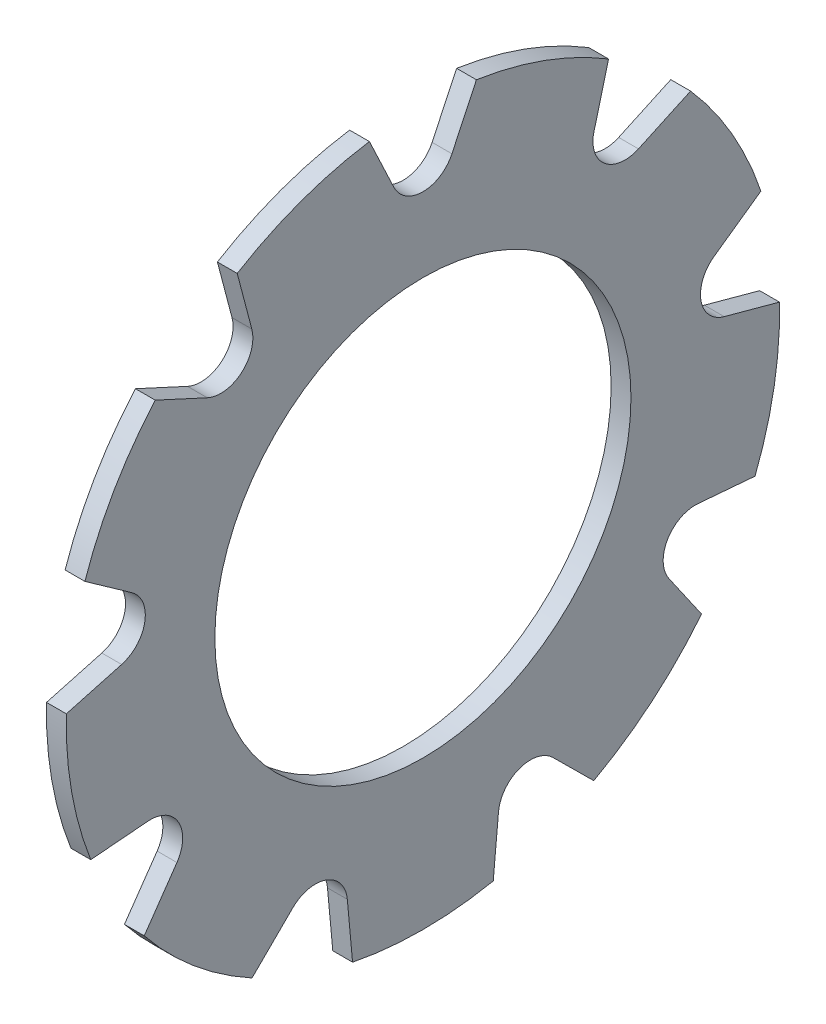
ISO-10303-21;
HEADER;
FILE_DESCRIPTION(('STEP AP214'),'2;1');
FILE_NAME('part.step','',(''),(''),'','','');
FILE_SCHEMA(('AUTOMOTIVE_DESIGN { 1 0 10303 214 1 1 1 1 }'));
ENDSEC;
DATA;
#1=APPLICATION_CONTEXT('core data for automotive mechanical design processes');
#2=APPLICATION_PROTOCOL_DEFINITION('international standard','automotive_design',2000,#1);
#3=PRODUCT_CONTEXT('',#1,'mechanical');
#4=PRODUCT('Part','Part','',(#3));
#5=PRODUCT_RELATED_PRODUCT_CATEGORY('part','',(#4));
#6=PRODUCT_DEFINITION_FORMATION('','',#4);
#7=PRODUCT_DEFINITION_CONTEXT('part definition',#1,'design');
#8=PRODUCT_DEFINITION('design','',#6,#7);
#9=PRODUCT_DEFINITION_SHAPE('','',#8);
#10=(LENGTH_UNIT() NAMED_UNIT(*) SI_UNIT(.MILLI.,.METRE.));
#11=(NAMED_UNIT(*) PLANE_ANGLE_UNIT() SI_UNIT($,.RADIAN.));
#12=(NAMED_UNIT(*) SI_UNIT($,.STERADIAN.) SOLID_ANGLE_UNIT());
#13=UNCERTAINTY_MEASURE_WITH_UNIT(LENGTH_MEASURE(1.E-05),#10,'distance_accuracy_value','');
#14=(GEOMETRIC_REPRESENTATION_CONTEXT(3) GLOBAL_UNCERTAINTY_ASSIGNED_CONTEXT((#13)) GLOBAL_UNIT_ASSIGNED_CONTEXT((#10,
#11,#12)) REPRESENTATION_CONTEXT('',''));
#15=CARTESIAN_POINT('',(0.,0.,0.));
#16=DIRECTION('',(0.,0.,1.));
#17=DIRECTION('',(1.,0.,0.));
#18=AXIS2_PLACEMENT_3D('',#15,#16,#17);
#19=CARTESIAN_POINT('',(-0.5,0.,0.));
#20=DIRECTION('',(1.,0.,0.));
#21=DIRECTION('',(0.,0.,-1.));
#22=AXIS2_PLACEMENT_3D('',#19,#20,#21);
#23=CYLINDRICAL_SURFACE('',#22,9.);
#24=DIRECTION('',(1.,0.,0.));
#25=VECTOR('',#24,1.);
#26=CARTESIAN_POINT('',(-0.5,5.94863345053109,-6.75379597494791));
#27=LINE('',#26,#25);
#28=CARTESIAN_POINT('',(-0.5,5.94863345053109,-6.75379597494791));
#29=VERTEX_POINT('',#28);
#30=CARTESIAN_POINT('',(0.,5.94863345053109,-6.75379597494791));
#31=VERTEX_POINT('',#30);
#32=EDGE_CURVE('E299',#29,#31,#27,.T.);
#33=ORIENTED_EDGE('',*,*,#32,.T.);
#34=CARTESIAN_POINT('',(0.,0.,0.));
#35=DIRECTION('',(1.,0.,0.));
#36=DIRECTION('',(0.,0.,-1.));
#37=AXIS2_PLACEMENT_3D('',#34,#35,#36);
#38=CIRCLE('',#37,9.);
#39=CARTESIAN_POINT('',(0.,2.87464216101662,-8.5285656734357));
#40=VERTEX_POINT('',#39);
#41=EDGE_CURVE('E526',#40,#31,#38,.T.);
#42=ORIENTED_EDGE('',*,*,#41,.F.);
#43=DIRECTION('',(1.,0.,0.));
#44=VECTOR('',#43,1.);
#45=CARTESIAN_POINT('',(-0.5,2.87464216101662,-8.5285656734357));
#46=LINE('',#45,#44);
#47=CARTESIAN_POINT('',(-0.5,2.87464216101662,-8.5285656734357));
#48=VERTEX_POINT('',#47);
#49=EDGE_CURVE('E59',#48,#40,#46,.T.);
#50=ORIENTED_EDGE('',*,*,#49,.F.);
#51=CARTESIAN_POINT('',(-0.5,0.,0.));
#52=DIRECTION('',(1.,0.,0.));
#53=DIRECTION('',(0.,0.,-1.));
#54=AXIS2_PLACEMENT_3D('',#51,#52,#53);
#55=CIRCLE('',#54,9.);
#56=EDGE_CURVE('E523',#48,#29,#55,.T.);
#57=ORIENTED_EDGE('',*,*,#56,.T.);
#58=EDGE_LOOP('',(#33,#42,#50,#57));
#59=FACE_BOUND('',#58,.T.);
#60=ADVANCED_FACE('F35',(#59),#23,.T.);
#61=DIRECTION('',(1.,0.,0.));
#62=VECTOR('',#61,1.);
#63=CARTESIAN_POINT('',(-0.5,0.215661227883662,-8.99741575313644));
#64=LINE('',#63,#62);
#65=CARTESIAN_POINT('',(-0.5,0.215661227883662,-8.99741575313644));
#66=VERTEX_POINT('',#65);
#67=CARTESIAN_POINT('',(0.,0.215661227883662,-8.99741575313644));
#68=VERTEX_POINT('',#67);
#69=EDGE_CURVE('E320',#66,#68,#64,.T.);
#70=ORIENTED_EDGE('',*,*,#69,.T.);
#71=CARTESIAN_POINT('',(0.,-3.2799526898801,-8.3810447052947));
#72=VERTEX_POINT('',#71);
#73=EDGE_CURVE('E528',#72,#68,#38,.T.);
#74=ORIENTED_EDGE('',*,*,#73,.F.);
#75=DIRECTION('',(1.,0.,0.));
#76=VECTOR('',#75,1.);
#77=CARTESIAN_POINT('',(-0.5,-3.2799526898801,-8.3810447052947));
#78=LINE('',#77,#76);
#79=CARTESIAN_POINT('',(-0.5,-3.2799526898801,-8.3810447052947));
#80=VERTEX_POINT('',#79);
#81=EDGE_CURVE('E345',#80,#72,#78,.T.);
#82=ORIENTED_EDGE('',*,*,#81,.F.);
#83=EDGE_CURVE('E621',#80,#66,#55,.T.);
#84=ORIENTED_EDGE('',*,*,#83,.T.);
#85=EDGE_LOOP('',(#70,#74,#82,#84));
#86=FACE_BOUND('',#85,.T.);
#87=ADVANCED_FACE('F619',(#86),#23,.T.);
#88=DIRECTION('',(1.,0.,0.));
#89=VECTOR('',#88,1.);
#90=CARTESIAN_POINT('',(-0.5,-5.6182212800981,-7.03104470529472));
#91=LINE('',#90,#89);
#92=CARTESIAN_POINT('',(-0.5,-5.6182212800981,-7.03104470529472));
#93=VERTEX_POINT('',#92);
#94=CARTESIAN_POINT('',(0.,-5.6182212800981,-7.03104470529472));
#95=VERTEX_POINT('',#94);
#96=EDGE_CURVE('E346',#93,#95,#91,.T.);
#97=ORIENTED_EDGE('',*,*,#96,.T.);
#98=CARTESIAN_POINT('',(0.,-7.89982122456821,-4.31193977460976));
#99=VERTEX_POINT('',#98);
#100=EDGE_CURVE('E531',#99,#95,#38,.T.);
#101=ORIENTED_EDGE('',*,*,#100,.F.);
#102=DIRECTION('',(1.,0.,0.));
#103=VECTOR('',#102,1.);
#104=CARTESIAN_POINT('',(-0.5,-7.89982122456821,-4.31193977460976));
#105=LINE('',#104,#103);
#106=CARTESIAN_POINT('',(-0.5,-7.89982122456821,-4.31193977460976));
#107=VERTEX_POINT('',#106);
#108=EDGE_CURVE('E371',#107,#99,#105,.T.);
#109=ORIENTED_EDGE('',*,*,#108,.F.);
#110=EDGE_CURVE('E607',#107,#93,#55,.T.);
#111=ORIENTED_EDGE('',*,*,#110,.T.);
#112=EDGE_LOOP('',(#97,#101,#109,#111));
#113=FACE_BOUND('',#112,.T.);
#114=ADVANCED_FACE('F605',(#113),#23,.T.);
#115=DIRECTION('',(1.,0.,0.));
#116=VECTOR('',#115,1.);
#117=CARTESIAN_POINT('',(-0.5,-8.82327561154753,-1.77476969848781));
#118=LINE('',#117,#116);
#119=CARTESIAN_POINT('',(-0.5,-8.82327561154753,-1.77476969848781));
#120=VERTEX_POINT('',#119);
#121=CARTESIAN_POINT('',(0.,-8.82327561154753,-1.77476969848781));
#122=VERTEX_POINT('',#121);
#123=EDGE_CURVE('E372',#120,#122,#118,.T.);
#124=ORIENTED_EDGE('',*,*,#123,.T.);
#125=CARTESIAN_POINT('',(0.,-8.82327561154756,1.77476969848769));
#126=VERTEX_POINT('',#125);
#127=EDGE_CURVE('E536',#126,#122,#38,.T.);
#128=ORIENTED_EDGE('',*,*,#127,.F.);
#129=DIRECTION('',(1.,0.,0.));
#130=VECTOR('',#129,1.);
#131=CARTESIAN_POINT('',(-0.5,-8.82327561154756,1.7747696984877));
#132=LINE('',#131,#130);
#133=CARTESIAN_POINT('',(-0.5,-8.82327561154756,1.7747696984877));
#134=VERTEX_POINT('',#133);
#135=EDGE_CURVE('E397',#134,#126,#132,.T.);
#136=ORIENTED_EDGE('',*,*,#135,.F.);
#137=EDGE_CURVE('E593',#134,#120,#55,.T.);
#138=ORIENTED_EDGE('',*,*,#137,.T.);
#139=EDGE_LOOP('',(#124,#128,#136,#138));
#140=FACE_BOUND('',#139,.T.);
#141=ADVANCED_FACE('F591',(#140),#23,.T.);
#142=DIRECTION('',(1.,0.,0.));
#143=VECTOR('',#142,1.);
#144=CARTESIAN_POINT('',(-0.5,-7.89982122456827,4.31193977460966));
#145=LINE('',#144,#143);
#146=CARTESIAN_POINT('',(-0.5,-7.89982122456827,4.31193977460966));
#147=VERTEX_POINT('',#146);
#148=CARTESIAN_POINT('',(0.,-7.89982122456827,4.31193977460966));
#149=VERTEX_POINT('',#148);
#150=EDGE_CURVE('E398',#147,#149,#145,.T.);
#151=ORIENTED_EDGE('',*,*,#150,.T.);
#152=CARTESIAN_POINT('',(0.,-5.61822128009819,7.03104470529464));
#153=VERTEX_POINT('',#152);
#154=EDGE_CURVE('E541',#153,#149,#38,.T.);
#155=ORIENTED_EDGE('',*,*,#154,.F.);
#156=DIRECTION('',(1.,0.,0.));
#157=VECTOR('',#156,1.);
#158=CARTESIAN_POINT('',(-0.5,-5.61822128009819,7.03104470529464));
#159=LINE('',#158,#157);
#160=CARTESIAN_POINT('',(-0.5,-5.61822128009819,7.03104470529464));
#161=VERTEX_POINT('',#160);
#162=EDGE_CURVE('E423',#161,#153,#159,.T.);
#163=ORIENTED_EDGE('',*,*,#162,.F.);
#164=EDGE_CURVE('E579',#161,#147,#55,.T.);
#165=ORIENTED_EDGE('',*,*,#164,.T.);
#166=EDGE_LOOP('',(#151,#155,#163,#165));
#167=FACE_BOUND('',#166,.T.);
#168=ADVANCED_FACE('F577',(#167),#23,.T.);
#169=DIRECTION('',(1.,0.,0.));
#170=VECTOR('',#169,1.);
#171=CARTESIAN_POINT('',(-0.5,-3.27995268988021,8.38104470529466));
#172=LINE('',#171,#170);
#173=CARTESIAN_POINT('',(-0.5,-3.27995268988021,8.38104470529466));
#174=VERTEX_POINT('',#173);
#175=CARTESIAN_POINT('',(0.,-3.27995268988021,8.38104470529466));
#176=VERTEX_POINT('',#175);
#177=EDGE_CURVE('E424',#174,#176,#172,.T.);
#178=ORIENTED_EDGE('',*,*,#177,.T.);
#179=CARTESIAN_POINT('',(0.,0.215661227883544,8.99741575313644));
#180=VERTEX_POINT('',#179);
#181=EDGE_CURVE('E525',#180,#176,#38,.T.);
#182=ORIENTED_EDGE('',*,*,#181,.F.);
#183=DIRECTION('',(1.,0.,0.));
#184=VECTOR('',#183,1.);
#185=CARTESIAN_POINT('',(-0.5,0.215661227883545,8.99741575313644));
#186=LINE('',#185,#184);
#187=CARTESIAN_POINT('',(-0.5,0.215661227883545,8.99741575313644));
#188=VERTEX_POINT('',#187);
#189=EDGE_CURVE('E449',#188,#180,#186,.T.);
#190=ORIENTED_EDGE('',*,*,#189,.F.);
#191=EDGE_CURVE('E564',#188,#174,#55,.T.);
#192=ORIENTED_EDGE('',*,*,#191,.T.);
#193=EDGE_LOOP('',(#178,#182,#190,#192));
#194=FACE_BOUND('',#193,.T.);
#195=ADVANCED_FACE('F561',(#194),#23,.T.);
#196=DIRECTION('',(1.,0.,0.));
#197=VECTOR('',#196,1.);
#198=CARTESIAN_POINT('',(-0.5,2.87464216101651,8.52856567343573));
#199=LINE('',#198,#197);
#200=CARTESIAN_POINT('',(-0.5,2.87464216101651,8.52856567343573));
#201=VERTEX_POINT('',#200);
#202=CARTESIAN_POINT('',(0.,2.87464216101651,8.52856567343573));
#203=VERTEX_POINT('',#202);
#204=EDGE_CURVE('E450',#201,#203,#199,.T.);
#205=ORIENTED_EDGE('',*,*,#204,.T.);
#206=CARTESIAN_POINT('',(0.,5.948633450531,6.75379597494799));
#207=VERTEX_POINT('',#206);
#208=EDGE_CURVE('E519',#207,#203,#38,.T.);
#209=ORIENTED_EDGE('',*,*,#208,.F.);
#210=DIRECTION('',(1.,0.,0.));
#211=VECTOR('',#210,1.);
#212=CARTESIAN_POINT('',(-0.5,5.948633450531,6.75379597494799));
#213=LINE('',#212,#211);
#214=CARTESIAN_POINT('',(-0.5,5.948633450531,6.75379597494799));
#215=VERTEX_POINT('',#214);
#216=EDGE_CURVE('E475',#215,#207,#213,.T.);
#217=ORIENTED_EDGE('',*,*,#216,.F.);
#218=EDGE_CURVE('E43',#215,#201,#55,.T.);
#219=ORIENTED_EDGE('',*,*,#218,.T.);
#220=EDGE_LOOP('',(#205,#209,#217,#219));
#221=FACE_BOUND('',#220,.T.);
#222=ADVANCED_FACE('F664',(#221),#23,.T.);
#223=DIRECTION('',(1.,0.,0.));
#224=VECTOR('',#223,1.);
#225=CARTESIAN_POINT('',(-0.5,7.68415999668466,4.68547597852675));
#226=LINE('',#225,#224);
#227=CARTESIAN_POINT('',(-0.5,7.68415999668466,4.68547597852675));
#228=VERTEX_POINT('',#227);
#229=CARTESIAN_POINT('',(0.,7.68415999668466,4.68547597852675));
#230=VERTEX_POINT('',#229);
#231=EDGE_CURVE('E476',#228,#230,#226,.T.);
#232=ORIENTED_EDGE('',*,*,#231,.T.);
#233=CARTESIAN_POINT('',(0.,8.89817396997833,1.35));
#234=VERTEX_POINT('',#233);
#235=EDGE_CURVE('E517',#234,#230,#38,.T.);
#236=ORIENTED_EDGE('',*,*,#235,.F.);
#237=DIRECTION('',(1.,0.,0.));
#238=VECTOR('',#237,1.);
#239=CARTESIAN_POINT('',(-0.5,8.89817396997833,1.35));
#240=LINE('',#239,#238);
#241=CARTESIAN_POINT('',(-0.5,8.89817396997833,1.35));
#242=VERTEX_POINT('',#241);
#243=EDGE_CURVE('E502',#242,#234,#240,.T.);
#244=ORIENTED_EDGE('',*,*,#243,.F.);
#245=EDGE_CURVE('E11',#242,#228,#55,.T.);
#246=ORIENTED_EDGE('',*,*,#245,.T.);
#247=EDGE_LOOP('',(#232,#236,#244,#246));
#248=FACE_BOUND('',#247,.T.);
#249=ADVANCED_FACE('F649',(#248),#23,.T.);
#250=DIRECTION('',(1.,0.,0.));
#251=VECTOR('',#250,1.);
#252=CARTESIAN_POINT('',(-0.5,7.68415999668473,-4.68547597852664));
#253=LINE('',#252,#251);
#254=CARTESIAN_POINT('',(-0.5,7.68415999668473,-4.68547597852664));
#255=VERTEX_POINT('',#254);
#256=CARTESIAN_POINT('',(0.,7.68415999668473,-4.68547597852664));
#257=VERTEX_POINT('',#256);
#258=EDGE_CURVE('E51',#255,#257,#253,.T.);
#259=ORIENTED_EDGE('',*,*,#258,.F.);
#260=CARTESIAN_POINT('',(-0.5,8.89817396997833,-1.35));
#261=VERTEX_POINT('',#260);
#262=EDGE_CURVE('E44',#255,#261,#55,.T.);
#263=ORIENTED_EDGE('',*,*,#262,.T.);
#264=DIRECTION('',(1.,0.,0.));
#265=VECTOR('',#264,1.);
#266=CARTESIAN_POINT('',(-0.5,8.89817396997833,-1.35));
#267=LINE('',#266,#265);
#268=CARTESIAN_POINT('',(0.,8.89817396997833,-1.35));
#269=VERTEX_POINT('',#268);
#270=EDGE_CURVE('E503',#261,#269,#267,.T.);
#271=ORIENTED_EDGE('',*,*,#270,.T.);
#272=EDGE_CURVE('E516',#257,#269,#38,.T.);
#273=ORIENTED_EDGE('',*,*,#272,.F.);
#274=EDGE_LOOP('',(#259,#263,#271,#273));
#275=FACE_BOUND('',#274,.T.);
#276=ADVANCED_FACE('F37',(#275),#23,.T.);
#277=CARTESIAN_POINT('',(-0.5,0.,0.));
#278=DIRECTION('',(1.,0.,0.));
#279=DIRECTION('',(0.,0.,-1.));
#280=AXIS2_PLACEMENT_3D('',#277,#278,#279);
#281=PLANE('',#280);
#282=CARTESIAN_POINT('',(-0.5,0.,0.));
#283=DIRECTION('',(1.,0.,0.));
#284=DIRECTION('',(0.,0.,-1.));
#285=AXIS2_PLACEMENT_3D('',#282,#283,#284);
#286=CIRCLE('',#285,5.25);
#287=CARTESIAN_POINT('',(-0.5,0.,-5.25));
#288=VERTEX_POINT('',#287);
#289=EDGE_CURVE('E514',#288,#288,#286,.T.);
#290=ORIENTED_EDGE('',*,*,#289,.T.);
#291=EDGE_LOOP('',(#290));
#292=FACE_BOUND('',#291,.T.);
#293=CARTESIAN_POINT('',(-0.5,6.07856265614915,-5.10051968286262));
#294=DIRECTION('',(1.,0.,0.));
#295=DIRECTION('',(0.,-0.64278760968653,-0.766044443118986));
#296=AXIS2_PLACEMENT_3D('',#293,#294,#295);
#297=CIRCLE('',#296,0.809999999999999);
#298=CARTESIAN_POINT('',(-0.5,6.28470657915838,-4.31719045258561));
#299=VERTEX_POINT('',#298);
#300=CARTESIAN_POINT('',(-0.5,5.34293047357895,-5.43955550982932));
#301=VERTEX_POINT('',#300);
#302=EDGE_CURVE('E277',#299,#301,#297,.T.);
#303=ORIENTED_EDGE('',*,*,#302,.T.);
#304=DIRECTION('',(0.,0.418562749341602,-0.908187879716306));
#305=VECTOR('',#304,1.);
#306=CARTESIAN_POINT('',(-0.5,5.34293047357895,-5.43955550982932));
#307=LINE('',#306,#305);
#308=EDGE_CURVE('E296',#301,#29,#307,.T.);
#309=ORIENTED_EDGE('',*,*,#308,.T.);
#310=ORIENTED_EDGE('',*,*,#56,.F.);
#311=DIRECTION('',(0.,-0.577232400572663,0.816579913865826));
#312=VECTOR('',#311,1.);
#313=CARTESIAN_POINT('',(-0.5,2.03932802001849,-7.346891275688));
#314=LINE('',#313,#312);
#315=CARTESIAN_POINT('',(-0.5,2.03932802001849,-7.346891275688));
#316=VERTEX_POINT('',#315);
#317=EDGE_CURVE('E311',#48,#316,#314,.T.);
#318=ORIENTED_EDGE('',*,*,#317,.T.);
#319=CARTESIAN_POINT('',(-0.5,1.37789828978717,-7.81444952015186));
#320=DIRECTION('',(1.,0.,0.));
#321=DIRECTION('',(0.,-0.984807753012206,-0.17364817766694));
#322=AXIS2_PLACEMENT_3D('',#319,#320,#321);
#323=CIRCLE('',#322,0.809999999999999);
#324=CARTESIAN_POINT('',(-0.5,0.596443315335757,-7.60131077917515));
#325=VERTEX_POINT('',#324);
#326=EDGE_CURVE('E314',#316,#325,#323,.T.);
#327=ORIENTED_EDGE('',*,*,#326,.T.);
#328=DIRECTION('',(0.,-0.263134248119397,-0.964759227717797));
#329=VECTOR('',#328,1.);
#330=CARTESIAN_POINT('',(-0.5,0.596443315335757,-7.60131077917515));
#331=LINE('',#330,#329);
#332=EDGE_CURVE('E317',#325,#66,#331,.T.);
#333=ORIENTED_EDGE('',*,*,#332,.T.);
#334=ORIENTED_EDGE('',*,*,#83,.F.);
#335=DIRECTION('',(0.,0.0827017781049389,0.996574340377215));
#336=VECTOR('',#335,1.);
#337=CARTESIAN_POINT('',(-0.5,-3.16027478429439,-6.93890001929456));
#338=LINE('',#337,#336);
#339=CARTESIAN_POINT('',(-0.5,-3.16027478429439,-6.93890001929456));
#340=VERTEX_POINT('',#339);
#341=EDGE_CURVE('E336',#80,#340,#338,.T.);
#342=ORIENTED_EDGE('',*,*,#341,.T.);
#343=CARTESIAN_POINT('',(-0.5,-3.96749999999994,-6.87191157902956));
#344=DIRECTION('',(1.,0.,0.));
#345=DIRECTION('',(0.,-0.866025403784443,0.499999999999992));
#346=AXIS2_PLACEMENT_3D('',#343,#344,#345);
#347=CIRCLE('',#346,0.809999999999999);
#348=CARTESIAN_POINT('',(-0.5,-4.42912629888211,-6.20632825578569));
#349=VERTEX_POINT('',#348);
#350=EDGE_CURVE('E339',#340,#349,#347,.T.);
#351=ORIENTED_EDGE('',*,*,#350,.T.);
#352=DIRECTION('',(0.,-0.821707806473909,-0.569909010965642));
#353=VECTOR('',#352,1.);
#354=CARTESIAN_POINT('',(-0.5,-4.42912629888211,-6.20632825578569));
#355=LINE('',#354,#353);
#356=EDGE_CURVE('E342',#349,#93,#355,.T.);
#357=ORIENTED_EDGE('',*,*,#356,.T.);
#358=ORIENTED_EDGE('',*,*,#110,.F.);
#359=DIRECTION('',(0.,0.703938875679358,0.710260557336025));
#360=VECTOR('',#359,1.);
#361=CARTESIAN_POINT('',(-0.5,-6.88114989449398,-3.28412032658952));
#362=LINE('',#361,#360);
#363=CARTESIAN_POINT('',(-0.5,-6.88114989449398,-3.28412032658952));
#364=VERTEX_POINT('',#363);
#365=EDGE_CURVE('E362',#107,#364,#362,.T.);
#366=ORIENTED_EDGE('',*,*,#365,.T.);
#367=CARTESIAN_POINT('',(-0.5,-7.45646094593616,-2.71392983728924));
#368=DIRECTION('',(1.,0.,0.));
#369=DIRECTION('',(0.,-0.342020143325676,0.939692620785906));
#370=AXIS2_PLACEMENT_3D('',#367,#368,#369);
#371=CIRCLE('',#370,0.809999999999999);
#372=CARTESIAN_POINT('',(-0.5,-7.38225849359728,-1.9073357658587));
#373=VERTEX_POINT('',#372);
#374=EDGE_CURVE('E365',#364,#373,#371,.T.);
#375=ORIENTED_EDGE('',*,*,#374,.T.);
#376=DIRECTION('',(0.,-0.995795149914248,0.0916079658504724));
#377=VECTOR('',#376,1.);
#378=CARTESIAN_POINT('',(-0.5,-7.38225849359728,-1.9073357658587));
#379=LINE('',#378,#377);
#380=EDGE_CURVE('E368',#373,#120,#379,.T.);
#381=ORIENTED_EDGE('',*,*,#380,.T.);
#382=ORIENTED_EDGE('',*,*,#137,.F.);
#383=DIRECTION('',(0.,0.995795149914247,0.0916079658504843));
#384=VECTOR('',#383,1.);
#385=CARTESIAN_POINT('',(-0.5,-7.38225849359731,1.9073357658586));
#386=LINE('',#385,#384);
#387=CARTESIAN_POINT('',(-0.5,-7.38225849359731,1.9073357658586));
#388=VERTEX_POINT('',#387);
#389=EDGE_CURVE('E388',#134,#388,#386,.T.);
#390=ORIENTED_EDGE('',*,*,#389,.T.);
#391=CARTESIAN_POINT('',(-0.5,-7.4564609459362,2.71392983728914));
#392=DIRECTION('',(1.,0.,0.));
#393=DIRECTION('',(0.,0.342020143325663,0.939692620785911));
#394=AXIS2_PLACEMENT_3D('',#391,#392,#393);
#395=CIRCLE('',#394,0.809999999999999);
#396=CARTESIAN_POINT('',(-0.5,-6.88114989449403,3.28412032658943));
#397=VERTEX_POINT('',#396);
#398=EDGE_CURVE('E391',#388,#397,#395,.T.);
#399=ORIENTED_EDGE('',*,*,#398,.T.);
#400=DIRECTION('',(0.,-0.703938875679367,0.710260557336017));
#401=VECTOR('',#400,1.);
#402=CARTESIAN_POINT('',(-0.5,-6.88114989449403,3.28412032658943));
#403=LINE('',#402,#401);
#404=EDGE_CURVE('E394',#397,#147,#403,.T.);
#405=ORIENTED_EDGE('',*,*,#404,.T.);
#406=ORIENTED_EDGE('',*,*,#164,.F.);
#407=DIRECTION('',(0.,0.821707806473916,-0.569909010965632));
#408=VECTOR('',#407,1.);
#409=CARTESIAN_POINT('',(-0.5,-4.42912629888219,6.20632825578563));
#410=LINE('',#409,#408);
#411=CARTESIAN_POINT('',(-0.5,-4.42912629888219,6.20632825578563));
#412=VERTEX_POINT('',#411);
#413=EDGE_CURVE('E414',#161,#412,#410,.T.);
#414=ORIENTED_EDGE('',*,*,#413,.T.);
#415=CARTESIAN_POINT('',(-0.5,-3.96750000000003,6.8719115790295));
#416=DIRECTION('',(1.,0.,0.));
#417=DIRECTION('',(0.,0.866025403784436,0.500000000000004));
#418=AXIS2_PLACEMENT_3D('',#415,#416,#417);
#419=CIRCLE('',#418,0.809999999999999);
#420=CARTESIAN_POINT('',(-0.5,-3.16027478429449,6.93890001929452));
#421=VERTEX_POINT('',#420);
#422=EDGE_CURVE('E417',#412,#421,#419,.T.);
#423=ORIENTED_EDGE('',*,*,#422,.T.);
#424=DIRECTION('',(0.,-0.0827017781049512,0.996574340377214));
#425=VECTOR('',#424,1.);
#426=CARTESIAN_POINT('',(-0.5,-3.16027478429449,6.93890001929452));
#427=LINE('',#426,#425);
#428=EDGE_CURVE('E420',#421,#174,#427,.T.);
#429=ORIENTED_EDGE('',*,*,#428,.T.);
#430=ORIENTED_EDGE('',*,*,#191,.F.);
#431=DIRECTION('',(0.,0.263134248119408,-0.964759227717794));
#432=VECTOR('',#431,1.);
#433=CARTESIAN_POINT('',(-0.5,0.596443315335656,7.60131077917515));
#434=LINE('',#433,#432);
#435=CARTESIAN_POINT('',(-0.5,0.596443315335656,7.60131077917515));
#436=VERTEX_POINT('',#435);
#437=EDGE_CURVE('E440',#188,#436,#434,.T.);
#438=ORIENTED_EDGE('',*,*,#437,.T.);
#439=CARTESIAN_POINT('',(-0.5,1.37789828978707,7.81444952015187));
#440=DIRECTION('',(1.,0.,0.));
#441=DIRECTION('',(0.,0.984807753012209,-0.173648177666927));
#442=AXIS2_PLACEMENT_3D('',#439,#440,#441);
#443=CIRCLE('',#442,0.809999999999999);
#444=CARTESIAN_POINT('',(-0.5,2.03932802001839,7.34689127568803));
#445=VERTEX_POINT('',#444);
#446=EDGE_CURVE('E443',#436,#445,#443,.T.);
#447=ORIENTED_EDGE('',*,*,#446,.T.);
#448=DIRECTION('',(0.,0.577232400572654,0.816579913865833));
#449=VECTOR('',#448,1.);
#450=CARTESIAN_POINT('',(-0.5,2.03932802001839,7.34689127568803));
#451=LINE('',#450,#449);
#452=EDGE_CURVE('E446',#445,#201,#451,.T.);
#453=ORIENTED_EDGE('',*,*,#452,.T.);
#454=ORIENTED_EDGE('',*,*,#218,.F.);
#455=DIRECTION('',(0.,-0.418562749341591,-0.908187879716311));
#456=VECTOR('',#455,1.);
#457=CARTESIAN_POINT('',(-0.5,5.34293047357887,5.43955550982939));
#458=LINE('',#457,#456);
#459=CARTESIAN_POINT('',(-0.5,5.34293047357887,5.43955550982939));
#460=VERTEX_POINT('',#459);
#461=EDGE_CURVE('E466',#215,#460,#458,.T.);
#462=ORIENTED_EDGE('',*,*,#461,.T.);
#463=CARTESIAN_POINT('',(-0.5,6.07856265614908,5.1005196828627));
#464=DIRECTION('',(1.,0.,0.));
#465=DIRECTION('',(0.,0.642787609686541,-0.766044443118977));
#466=AXIS2_PLACEMENT_3D('',#463,#464,#465);
#467=CIRCLE('',#466,0.809999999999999);
#468=CARTESIAN_POINT('',(-0.5,6.28470657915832,4.3171904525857));
#469=VERTEX_POINT('',#468);
#470=EDGE_CURVE('E469',#460,#469,#467,.T.);
#471=ORIENTED_EDGE('',*,*,#470,.T.);
#472=DIRECTION('',(0.,0.967073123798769,0.254498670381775));
#473=VECTOR('',#472,1.);
#474=CARTESIAN_POINT('',(-0.5,6.28470657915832,4.3171904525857));
#475=LINE('',#474,#473);
#476=EDGE_CURVE('E472',#469,#228,#475,.T.);
#477=ORIENTED_EDGE('',*,*,#476,.T.);
#478=ORIENTED_EDGE('',*,*,#245,.F.);
#479=DIRECTION('',(0.,-0.904409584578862,-0.426665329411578));
#480=VECTOR('',#479,1.);
#481=CARTESIAN_POINT('',(-0.5,7.58940108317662,0.732571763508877));
#482=LINE('',#481,#480);
#483=CARTESIAN_POINT('',(-0.5,7.58940108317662,0.732571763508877));
#484=VERTEX_POINT('',#483);
#485=EDGE_CURVE('E493',#242,#484,#482,.T.);
#486=ORIENTED_EDGE('',*,*,#485,.T.);
#487=CARTESIAN_POINT('',(-0.5,7.935,0.));
#488=DIRECTION('',(1.,0.,0.));
#489=DIRECTION('',(0.,0.,-1.));
#490=AXIS2_PLACEMENT_3D('',#487,#488,#489);
#491=CIRCLE('',#490,0.809999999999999);
#492=CARTESIAN_POINT('',(-0.5,7.58940108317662,-0.732571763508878));
#493=VERTEX_POINT('',#492);
#494=EDGE_CURVE('E496',#484,#493,#491,.T.);
#495=ORIENTED_EDGE('',*,*,#494,.T.);
#496=DIRECTION('',(0.,0.904409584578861,-0.42666532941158));
#497=VECTOR('',#496,1.);
#498=CARTESIAN_POINT('',(-0.5,7.58940108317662,-0.732571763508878));
#499=LINE('',#498,#497);
#500=EDGE_CURVE('E499',#493,#261,#499,.T.);
#501=ORIENTED_EDGE('',*,*,#500,.T.);
#502=ORIENTED_EDGE('',*,*,#262,.F.);
#503=DIRECTION('',(0.,-0.967073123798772,0.254498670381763));
#504=VECTOR('',#503,1.);
#505=CARTESIAN_POINT('',(-0.5,6.28470657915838,-4.31719045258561));
#506=LINE('',#505,#504);
#507=EDGE_CURVE('E291',#255,#299,#506,.T.);
#508=ORIENTED_EDGE('',*,*,#507,.T.);
#509=EDGE_LOOP('',(#303,#309,#310,#318,#327,#333,#334,#342,#351,#357,#358,#366,#375,#381,#382,
#390,#399,#405,#406,#414,#423,#429,#430,#438,#447,#453,#454,#462,#471,#477,#478,#486,#495,#501,
#502,#508));
#510=FACE_BOUND('',#509,.T.);
#511=ADVANCED_FACE('F569',(#292,#510),#281,.F.);
#512=CARTESIAN_POINT('',(0.,0.,0.));
#513=DIRECTION('',(1.,0.,0.));
#514=DIRECTION('',(0.,0.,-1.));
#515=AXIS2_PLACEMENT_3D('',#512,#513,#514);
#516=PLANE('',#515);
#517=DIRECTION('',(0.,0.418562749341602,-0.908187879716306));
#518=VECTOR('',#517,1.);
#519=CARTESIAN_POINT('',(0.,5.34293047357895,-5.43955550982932));
#520=LINE('',#519,#518);
#521=CARTESIAN_POINT('',(0.,5.34293047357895,-5.43955550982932));
#522=VERTEX_POINT('',#521);
#523=EDGE_CURVE('E289',#522,#31,#520,.T.);
#524=ORIENTED_EDGE('',*,*,#523,.F.);
#525=CARTESIAN_POINT('',(0.,6.07856265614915,-5.10051968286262));
#526=DIRECTION('',(1.,0.,0.));
#527=DIRECTION('',(0.,-0.64278760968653,-0.766044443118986));
#528=AXIS2_PLACEMENT_3D('',#525,#526,#527);
#529=CIRCLE('',#528,0.809999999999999);
#530=CARTESIAN_POINT('',(0.,6.28470657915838,-4.31719045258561));
#531=VERTEX_POINT('',#530);
#532=EDGE_CURVE('E274',#531,#522,#529,.T.);
#533=ORIENTED_EDGE('',*,*,#532,.F.);
#534=DIRECTION('',(0.,-0.967073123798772,0.254498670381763));
#535=VECTOR('',#534,1.);
#536=CARTESIAN_POINT('',(0.,6.28470657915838,-4.31719045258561));
#537=LINE('',#536,#535);
#538=EDGE_CURVE('E281',#257,#531,#537,.T.);
#539=ORIENTED_EDGE('',*,*,#538,.F.);
#540=ORIENTED_EDGE('',*,*,#272,.T.);
#541=DIRECTION('',(0.,0.904409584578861,-0.42666532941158));
#542=VECTOR('',#541,1.);
#543=CARTESIAN_POINT('',(0.,7.58940108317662,-0.732571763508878));
#544=LINE('',#543,#542);
#545=CARTESIAN_POINT('',(0.,7.58940108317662,-0.732571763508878));
#546=VERTEX_POINT('',#545);
#547=EDGE_CURVE('E490',#546,#269,#544,.T.);
#548=ORIENTED_EDGE('',*,*,#547,.F.);
#549=CARTESIAN_POINT('',(0.,7.935,0.));
#550=DIRECTION('',(1.,0.,0.));
#551=DIRECTION('',(0.,0.,-1.));
#552=AXIS2_PLACEMENT_3D('',#549,#550,#551);
#553=CIRCLE('',#552,0.809999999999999);
#554=CARTESIAN_POINT('',(0.,7.58940108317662,0.732571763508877));
#555=VERTEX_POINT('',#554);
#556=EDGE_CURVE('E487',#555,#546,#553,.T.);
#557=ORIENTED_EDGE('',*,*,#556,.F.);
#558=DIRECTION('',(0.,-0.904409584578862,-0.426665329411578));
#559=VECTOR('',#558,1.);
#560=CARTESIAN_POINT('',(0.,7.58940108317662,0.732571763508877));
#561=LINE('',#560,#559);
#562=EDGE_CURVE('E479',#234,#555,#561,.T.);
#563=ORIENTED_EDGE('',*,*,#562,.F.);
#564=ORIENTED_EDGE('',*,*,#235,.T.);
#565=DIRECTION('',(0.,0.967073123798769,0.254498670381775));
#566=VECTOR('',#565,1.);
#567=CARTESIAN_POINT('',(0.,6.28470657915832,4.3171904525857));
#568=LINE('',#567,#566);
#569=CARTESIAN_POINT('',(0.,6.28470657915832,4.3171904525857));
#570=VERTEX_POINT('',#569);
#571=EDGE_CURVE('E464',#570,#230,#568,.T.);
#572=ORIENTED_EDGE('',*,*,#571,.F.);
#573=CARTESIAN_POINT('',(0.,6.07856265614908,5.1005196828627));
#574=DIRECTION('',(1.,0.,0.));
#575=DIRECTION('',(0.,0.642787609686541,-0.766044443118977));
#576=AXIS2_PLACEMENT_3D('',#573,#574,#575);
#577=CIRCLE('',#576,0.809999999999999);
#578=CARTESIAN_POINT('',(0.,5.34293047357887,5.43955550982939));
#579=VERTEX_POINT('',#578);
#580=EDGE_CURVE('E461',#579,#570,#577,.T.);
#581=ORIENTED_EDGE('',*,*,#580,.F.);
#582=DIRECTION('',(0.,-0.418562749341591,-0.908187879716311));
#583=VECTOR('',#582,1.);
#584=CARTESIAN_POINT('',(0.,5.34293047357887,5.43955550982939));
#585=LINE('',#584,#583);
#586=EDGE_CURVE('E453',#207,#579,#585,.T.);
#587=ORIENTED_EDGE('',*,*,#586,.F.);
#588=ORIENTED_EDGE('',*,*,#208,.T.);
#589=DIRECTION('',(0.,0.577232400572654,0.816579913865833));
#590=VECTOR('',#589,1.);
#591=CARTESIAN_POINT('',(0.,2.03932802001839,7.34689127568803));
#592=LINE('',#591,#590);
#593=CARTESIAN_POINT('',(0.,2.03932802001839,7.34689127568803));
#594=VERTEX_POINT('',#593);
#595=EDGE_CURVE('E438',#594,#203,#592,.T.);
#596=ORIENTED_EDGE('',*,*,#595,.F.);
#597=CARTESIAN_POINT('',(0.,1.37789828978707,7.81444952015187));
#598=DIRECTION('',(1.,0.,0.));
#599=DIRECTION('',(0.,0.984807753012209,-0.173648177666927));
#600=AXIS2_PLACEMENT_3D('',#597,#598,#599);
#601=CIRCLE('',#600,0.809999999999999);
#602=CARTESIAN_POINT('',(0.,0.596443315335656,7.60131077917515));
#603=VERTEX_POINT('',#602);
#604=EDGE_CURVE('E435',#603,#594,#601,.T.);
#605=ORIENTED_EDGE('',*,*,#604,.F.);
#606=DIRECTION('',(0.,0.263134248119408,-0.964759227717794));
#607=VECTOR('',#606,1.);
#608=CARTESIAN_POINT('',(0.,0.596443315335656,7.60131077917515));
#609=LINE('',#608,#607);
#610=EDGE_CURVE('E427',#180,#603,#609,.T.);
#611=ORIENTED_EDGE('',*,*,#610,.F.);
#612=ORIENTED_EDGE('',*,*,#181,.T.);
#613=DIRECTION('',(0.,-0.0827017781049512,0.996574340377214));
#614=VECTOR('',#613,1.);
#615=CARTESIAN_POINT('',(0.,-3.16027478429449,6.93890001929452));
#616=LINE('',#615,#614);
#617=CARTESIAN_POINT('',(0.,-3.16027478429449,6.93890001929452));
#618=VERTEX_POINT('',#617);
#619=EDGE_CURVE('E412',#618,#176,#616,.T.);
#620=ORIENTED_EDGE('',*,*,#619,.F.);
#621=CARTESIAN_POINT('',(0.,-3.96750000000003,6.8719115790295));
#622=DIRECTION('',(1.,0.,0.));
#623=DIRECTION('',(0.,0.866025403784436,0.500000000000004));
#624=AXIS2_PLACEMENT_3D('',#621,#622,#623);
#625=CIRCLE('',#624,0.809999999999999);
#626=CARTESIAN_POINT('',(0.,-4.42912629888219,6.20632825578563));
#627=VERTEX_POINT('',#626);
#628=EDGE_CURVE('E409',#627,#618,#625,.T.);
#629=ORIENTED_EDGE('',*,*,#628,.F.);
#630=DIRECTION('',(0.,0.821707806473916,-0.569909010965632));
#631=VECTOR('',#630,1.);
#632=CARTESIAN_POINT('',(0.,-4.42912629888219,6.20632825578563));
#633=LINE('',#632,#631);
#634=EDGE_CURVE('E401',#153,#627,#633,.T.);
#635=ORIENTED_EDGE('',*,*,#634,.F.);
#636=ORIENTED_EDGE('',*,*,#154,.T.);
#637=DIRECTION('',(0.,-0.703938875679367,0.710260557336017));
#638=VECTOR('',#637,1.);
#639=CARTESIAN_POINT('',(0.,-6.88114989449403,3.28412032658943));
#640=LINE('',#639,#638);
#641=CARTESIAN_POINT('',(0.,-6.88114989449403,3.28412032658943));
#642=VERTEX_POINT('',#641);
#643=EDGE_CURVE('E386',#642,#149,#640,.T.);
#644=ORIENTED_EDGE('',*,*,#643,.F.);
#645=CARTESIAN_POINT('',(0.,-7.4564609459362,2.71392983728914));
#646=DIRECTION('',(1.,0.,0.));
#647=DIRECTION('',(0.,0.342020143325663,0.939692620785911));
#648=AXIS2_PLACEMENT_3D('',#645,#646,#647);
#649=CIRCLE('',#648,0.809999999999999);
#650=CARTESIAN_POINT('',(0.,-7.38225849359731,1.9073357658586));
#651=VERTEX_POINT('',#650);
#652=EDGE_CURVE('E383',#651,#642,#649,.T.);
#653=ORIENTED_EDGE('',*,*,#652,.F.);
#654=DIRECTION('',(0.,0.995795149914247,0.0916079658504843));
#655=VECTOR('',#654,1.);
#656=CARTESIAN_POINT('',(0.,-7.38225849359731,1.9073357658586));
#657=LINE('',#656,#655);
#658=EDGE_CURVE('E375',#126,#651,#657,.T.);
#659=ORIENTED_EDGE('',*,*,#658,.F.);
#660=ORIENTED_EDGE('',*,*,#127,.T.);
#661=DIRECTION('',(0.,-0.995795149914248,0.0916079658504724));
#662=VECTOR('',#661,1.);
#663=CARTESIAN_POINT('',(0.,-7.38225849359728,-1.9073357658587));
#664=LINE('',#663,#662);
#665=CARTESIAN_POINT('',(0.,-7.38225849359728,-1.9073357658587));
#666=VERTEX_POINT('',#665);
#667=EDGE_CURVE('E360',#666,#122,#664,.T.);
#668=ORIENTED_EDGE('',*,*,#667,.F.);
#669=CARTESIAN_POINT('',(0.,-7.45646094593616,-2.71392983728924));
#670=DIRECTION('',(1.,0.,0.));
#671=DIRECTION('',(0.,-0.342020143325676,0.939692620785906));
#672=AXIS2_PLACEMENT_3D('',#669,#670,#671);
#673=CIRCLE('',#672,0.809999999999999);
#674=CARTESIAN_POINT('',(0.,-6.88114989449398,-3.28412032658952));
#675=VERTEX_POINT('',#674);
#676=EDGE_CURVE('E357',#675,#666,#673,.T.);
#677=ORIENTED_EDGE('',*,*,#676,.F.);
#678=DIRECTION('',(0.,0.703938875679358,0.710260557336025));
#679=VECTOR('',#678,1.);
#680=CARTESIAN_POINT('',(0.,-6.88114989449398,-3.28412032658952));
#681=LINE('',#680,#679);
#682=EDGE_CURVE('E349',#99,#675,#681,.T.);
#683=ORIENTED_EDGE('',*,*,#682,.F.);
#684=ORIENTED_EDGE('',*,*,#100,.T.);
#685=DIRECTION('',(0.,-0.821707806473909,-0.569909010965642));
#686=VECTOR('',#685,1.);
#687=CARTESIAN_POINT('',(0.,-4.42912629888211,-6.20632825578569));
#688=LINE('',#687,#686);
#689=CARTESIAN_POINT('',(0.,-4.42912629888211,-6.20632825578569));
#690=VERTEX_POINT('',#689);
#691=EDGE_CURVE('E334',#690,#95,#688,.T.);
#692=ORIENTED_EDGE('',*,*,#691,.F.);
#693=CARTESIAN_POINT('',(0.,-3.96749999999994,-6.87191157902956));
#694=DIRECTION('',(1.,0.,0.));
#695=DIRECTION('',(0.,-0.866025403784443,0.499999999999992));
#696=AXIS2_PLACEMENT_3D('',#693,#694,#695);
#697=CIRCLE('',#696,0.809999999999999);
#698=CARTESIAN_POINT('',(0.,-3.16027478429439,-6.93890001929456));
#699=VERTEX_POINT('',#698);
#700=EDGE_CURVE('E331',#699,#690,#697,.T.);
#701=ORIENTED_EDGE('',*,*,#700,.F.);
#702=DIRECTION('',(0.,0.0827017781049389,0.996574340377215));
#703=VECTOR('',#702,1.);
#704=CARTESIAN_POINT('',(0.,-3.16027478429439,-6.93890001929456));
#705=LINE('',#704,#703);
#706=EDGE_CURVE('E323',#72,#699,#705,.T.);
#707=ORIENTED_EDGE('',*,*,#706,.F.);
#708=ORIENTED_EDGE('',*,*,#73,.T.);
#709=DIRECTION('',(0.,-0.263134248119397,-0.964759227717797));
#710=VECTOR('',#709,1.);
#711=CARTESIAN_POINT('',(0.,0.596443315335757,-7.60131077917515));
#712=LINE('',#711,#710);
#713=CARTESIAN_POINT('',(0.,0.596443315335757,-7.60131077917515));
#714=VERTEX_POINT('',#713);
#715=EDGE_CURVE('E309',#714,#68,#712,.T.);
#716=ORIENTED_EDGE('',*,*,#715,.F.);
#717=CARTESIAN_POINT('',(0.,1.37789828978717,-7.81444952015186));
#718=DIRECTION('',(1.,0.,0.));
#719=DIRECTION('',(0.,-0.984807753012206,-0.17364817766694));
#720=AXIS2_PLACEMENT_3D('',#717,#718,#719);
#721=CIRCLE('',#720,0.809999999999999);
#722=CARTESIAN_POINT('',(0.,2.03932802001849,-7.346891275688));
#723=VERTEX_POINT('',#722);
#724=EDGE_CURVE('E306',#723,#714,#721,.T.);
#725=ORIENTED_EDGE('',*,*,#724,.F.);
#726=DIRECTION('',(0.,-0.577232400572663,0.816579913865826));
#727=VECTOR('',#726,1.);
#728=CARTESIAN_POINT('',(0.,2.03932802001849,-7.346891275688));
#729=LINE('',#728,#727);
#730=EDGE_CURVE('E302',#40,#723,#729,.T.);
#731=ORIENTED_EDGE('',*,*,#730,.F.);
#732=ORIENTED_EDGE('',*,*,#41,.T.);
#733=EDGE_LOOP('',(#524,#533,#539,#540,#548,#557,#563,#564,#572,#581,#587,#588,#596,#605,#611,
#612,#620,#629,#635,#636,#644,#653,#659,#660,#668,#677,#683,#684,#692,#701,#707,#708,#716,#725,
#731,#732));
#734=FACE_BOUND('',#733,.T.);
#735=CARTESIAN_POINT('',(0.,0.,0.));
#736=DIRECTION('',(1.,0.,0.));
#737=DIRECTION('',(0.,0.,-1.));
#738=AXIS2_PLACEMENT_3D('',#735,#736,#737);
#739=CIRCLE('',#738,5.25);
#740=CARTESIAN_POINT('',(0.,0.,-5.25));
#741=VERTEX_POINT('',#740);
#742=EDGE_CURVE('E506',#741,#741,#739,.T.);
#743=ORIENTED_EDGE('',*,*,#742,.F.);
#744=EDGE_LOOP('',(#743));
#745=FACE_BOUND('',#744,.T.);
#746=ADVANCED_FACE('F286',(#734,#745),#516,.T.);
#747=CARTESIAN_POINT('',(-0.5,0.,0.));
#748=DIRECTION('',(1.,0.,0.));
#749=DIRECTION('',(0.,0.,-1.));
#750=AXIS2_PLACEMENT_3D('',#747,#748,#749);
#751=CYLINDRICAL_SURFACE('',#750,5.25);
#752=ORIENTED_EDGE('',*,*,#289,.F.);
#753=EDGE_LOOP('',(#752));
#754=FACE_BOUND('',#753,.T.);
#755=ORIENTED_EDGE('',*,*,#742,.T.);
#756=EDGE_LOOP('',(#755));
#757=FACE_BOUND('',#756,.T.);
#758=ADVANCED_FACE('F747',(#754,#757),#751,.F.);
#759=CARTESIAN_POINT('',(-0.5,7.58940108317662,-0.732571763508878));
#760=DIRECTION('',(0.,-0.42666532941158,-0.904409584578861));
#761=DIRECTION('',(0.,0.904409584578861,-0.42666532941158));
#762=AXIS2_PLACEMENT_3D('',#759,#760,#761);
#763=PLANE('',#762);
#764=ORIENTED_EDGE('',*,*,#547,.T.);
#765=ORIENTED_EDGE('',*,*,#270,.F.);
#766=ORIENTED_EDGE('',*,*,#500,.F.);
#767=DIRECTION('',(1.,0.,0.));
#768=VECTOR('',#767,1.);
#769=CARTESIAN_POINT('',(-0.5,7.58940108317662,-0.732571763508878));
#770=LINE('',#769,#768);
#771=EDGE_CURVE('E507',#493,#546,#770,.T.);
#772=ORIENTED_EDGE('',*,*,#771,.T.);
#773=EDGE_LOOP('',(#764,#765,#766,#772));
#774=FACE_BOUND('',#773,.T.);
#775=ADVANCED_FACE('F640',(#774),#763,.F.);
#776=CARTESIAN_POINT('',(-0.5,7.935,0.));
#777=DIRECTION('',(1.,0.,0.));
#778=DIRECTION('',(0.,0.,-1.));
#779=AXIS2_PLACEMENT_3D('',#776,#777,#778);
#780=CYLINDRICAL_SURFACE('',#779,0.809999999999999);
#781=ORIENTED_EDGE('',*,*,#556,.T.);
#782=ORIENTED_EDGE('',*,*,#771,.F.);
#783=ORIENTED_EDGE('',*,*,#494,.F.);
#784=DIRECTION('',(1.,0.,0.));
#785=VECTOR('',#784,1.);
#786=CARTESIAN_POINT('',(-0.5,7.58940108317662,0.732571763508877));
#787=LINE('',#786,#785);
#788=EDGE_CURVE('E509',#484,#555,#787,.T.);
#789=ORIENTED_EDGE('',*,*,#788,.T.);
#790=EDGE_LOOP('',(#781,#782,#783,#789));
#791=FACE_BOUND('',#790,.T.);
#792=ADVANCED_FACE('F644',(#791),#780,.F.);
#793=CARTESIAN_POINT('',(-0.5,7.58940108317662,0.732571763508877));
#794=DIRECTION('',(0.,-0.426665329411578,0.904409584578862));
#795=DIRECTION('',(0.,-0.904409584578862,-0.426665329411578));
#796=AXIS2_PLACEMENT_3D('',#793,#794,#795);
#797=PLANE('',#796);
#798=ORIENTED_EDGE('',*,*,#562,.T.);
#799=ORIENTED_EDGE('',*,*,#788,.F.);
#800=ORIENTED_EDGE('',*,*,#485,.F.);
#801=ORIENTED_EDGE('',*,*,#243,.T.);
#802=EDGE_LOOP('',(#798,#799,#800,#801));
#803=FACE_BOUND('',#802,.T.);
#804=ADVANCED_FACE('F724',(#803),#797,.F.);
#805=CARTESIAN_POINT('',(-0.5,6.28470657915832,4.3171904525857));
#806=DIRECTION('',(0.,0.254498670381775,-0.967073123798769));
#807=DIRECTION('',(0.,0.967073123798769,0.254498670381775));
#808=AXIS2_PLACEMENT_3D('',#805,#806,#807);
#809=PLANE('',#808);
#810=ORIENTED_EDGE('',*,*,#571,.T.);
#811=ORIENTED_EDGE('',*,*,#231,.F.);
#812=ORIENTED_EDGE('',*,*,#476,.F.);
#813=DIRECTION('',(1.,0.,0.));
#814=VECTOR('',#813,1.);
#815=CARTESIAN_POINT('',(-0.5,6.28470657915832,4.3171904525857));
#816=LINE('',#815,#814);
#817=EDGE_CURVE('E480',#469,#570,#816,.T.);
#818=ORIENTED_EDGE('',*,*,#817,.T.);
#819=EDGE_LOOP('',(#810,#811,#812,#818));
#820=FACE_BOUND('',#819,.T.);
#821=ADVANCED_FACE('F652',(#820),#809,.F.);
#822=CARTESIAN_POINT('',(-0.5,6.07856265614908,5.1005196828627));
#823=DIRECTION('',(1.,0.,0.));
#824=DIRECTION('',(0.,0.,-1.));
#825=AXIS2_PLACEMENT_3D('',#822,#823,#824);
#826=CYLINDRICAL_SURFACE('',#825,0.809999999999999);
#827=ORIENTED_EDGE('',*,*,#580,.T.);
#828=ORIENTED_EDGE('',*,*,#817,.F.);
#829=ORIENTED_EDGE('',*,*,#470,.F.);
#830=DIRECTION('',(1.,0.,0.));
#831=VECTOR('',#830,1.);
#832=CARTESIAN_POINT('',(-0.5,5.34293047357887,5.43955550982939));
#833=LINE('',#832,#831);
#834=EDGE_CURVE('E482',#460,#579,#833,.T.);
#835=ORIENTED_EDGE('',*,*,#834,.T.);
#836=EDGE_LOOP('',(#827,#828,#829,#835));
#837=FACE_BOUND('',#836,.T.);
#838=ADVANCED_FACE('F656',(#837),#826,.F.);
#839=CARTESIAN_POINT('',(-0.5,5.34293047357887,5.43955550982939));
#840=DIRECTION('',(0.,-0.908187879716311,0.418562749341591));
#841=DIRECTION('',(0.,-0.418562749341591,-0.908187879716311));
#842=AXIS2_PLACEMENT_3D('',#839,#840,#841);
#843=PLANE('',#842);
#844=ORIENTED_EDGE('',*,*,#586,.T.);
#845=ORIENTED_EDGE('',*,*,#834,.F.);
#846=ORIENTED_EDGE('',*,*,#461,.F.);
#847=ORIENTED_EDGE('',*,*,#216,.T.);
#848=EDGE_LOOP('',(#844,#845,#846,#847));
#849=FACE_BOUND('',#848,.T.);
#850=ADVANCED_FACE('F788',(#849),#843,.F.);
#851=CARTESIAN_POINT('',(-0.5,2.03932802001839,7.34689127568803));
#852=DIRECTION('',(0.,0.816579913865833,-0.577232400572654));
#853=DIRECTION('',(0.,0.577232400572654,0.816579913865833));
#854=AXIS2_PLACEMENT_3D('',#851,#852,#853);
#855=PLANE('',#854);
#856=ORIENTED_EDGE('',*,*,#595,.T.);
#857=ORIENTED_EDGE('',*,*,#204,.F.);
#858=ORIENTED_EDGE('',*,*,#452,.F.);
#859=DIRECTION('',(1.,0.,0.));
#860=VECTOR('',#859,1.);
#861=CARTESIAN_POINT('',(-0.5,2.03932802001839,7.34689127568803));
#862=LINE('',#861,#860);
#863=EDGE_CURVE('E454',#445,#594,#862,.T.);
#864=ORIENTED_EDGE('',*,*,#863,.T.);
#865=EDGE_LOOP('',(#856,#857,#858,#864));
#866=FACE_BOUND('',#865,.T.);
#867=ADVANCED_FACE('F668',(#866),#855,.F.);
#868=CARTESIAN_POINT('',(-0.5,1.37789828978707,7.81444952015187));
#869=DIRECTION('',(1.,0.,0.));
#870=DIRECTION('',(0.,0.,-1.));
#871=AXIS2_PLACEMENT_3D('',#868,#869,#870);
#872=CYLINDRICAL_SURFACE('',#871,0.809999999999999);
#873=ORIENTED_EDGE('',*,*,#604,.T.);
#874=ORIENTED_EDGE('',*,*,#863,.F.);
#875=ORIENTED_EDGE('',*,*,#446,.F.);
#876=DIRECTION('',(1.,0.,0.));
#877=VECTOR('',#876,1.);
#878=CARTESIAN_POINT('',(-0.5,0.596443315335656,7.60131077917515));
#879=LINE('',#878,#877);
#880=EDGE_CURVE('E456',#436,#603,#879,.T.);
#881=ORIENTED_EDGE('',*,*,#880,.T.);
#882=EDGE_LOOP('',(#873,#874,#875,#881));
#883=FACE_BOUND('',#882,.T.);
#884=ADVANCED_FACE('F671',(#883),#872,.F.);
#885=CARTESIAN_POINT('',(-0.5,0.596443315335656,7.60131077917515));
#886=DIRECTION('',(0.,-0.964759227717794,-0.263134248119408));
#887=DIRECTION('',(0.,0.263134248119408,-0.964759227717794));
#888=AXIS2_PLACEMENT_3D('',#885,#886,#887);
#889=PLANE('',#888);
#890=ORIENTED_EDGE('',*,*,#610,.T.);
#891=ORIENTED_EDGE('',*,*,#880,.F.);
#892=ORIENTED_EDGE('',*,*,#437,.F.);
#893=ORIENTED_EDGE('',*,*,#189,.T.);
#894=EDGE_LOOP('',(#890,#891,#892,#893));
#895=FACE_BOUND('',#894,.T.);
#896=ADVANCED_FACE('F673',(#895),#889,.F.);
#897=CARTESIAN_POINT('',(-0.5,-3.16027478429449,6.93890001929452));
#898=DIRECTION('',(0.,0.996574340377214,0.0827017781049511));
#899=DIRECTION('',(0.,-0.0827017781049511,0.996574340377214));
#900=AXIS2_PLACEMENT_3D('',#897,#898,#899);
#901=PLANE('',#900);
#902=ORIENTED_EDGE('',*,*,#619,.T.);
#903=ORIENTED_EDGE('',*,*,#177,.F.);
#904=ORIENTED_EDGE('',*,*,#428,.F.);
#905=DIRECTION('',(1.,0.,0.));
#906=VECTOR('',#905,1.);
#907=CARTESIAN_POINT('',(-0.5,-3.16027478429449,6.93890001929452));
#908=LINE('',#907,#906);
#909=EDGE_CURVE('E428',#421,#618,#908,.T.);
#910=ORIENTED_EDGE('',*,*,#909,.T.);
#911=EDGE_LOOP('',(#902,#903,#904,#910));
#912=FACE_BOUND('',#911,.T.);
#913=ADVANCED_FACE('F567',(#912),#901,.F.);
#914=CARTESIAN_POINT('',(-0.5,-3.96750000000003,6.8719115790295));
#915=DIRECTION('',(1.,0.,0.));
#916=DIRECTION('',(0.,0.,-1.));
#917=AXIS2_PLACEMENT_3D('',#914,#915,#916);
#918=CYLINDRICAL_SURFACE('',#917,0.809999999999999);
#919=ORIENTED_EDGE('',*,*,#628,.T.);
#920=ORIENTED_EDGE('',*,*,#909,.F.);
#921=ORIENTED_EDGE('',*,*,#422,.F.);
#922=DIRECTION('',(1.,0.,0.));
#923=VECTOR('',#922,1.);
#924=CARTESIAN_POINT('',(-0.5,-4.42912629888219,6.20632825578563));
#925=LINE('',#924,#923);
#926=EDGE_CURVE('E430',#412,#627,#925,.T.);
#927=ORIENTED_EDGE('',*,*,#926,.T.);
#928=EDGE_LOOP('',(#919,#920,#921,#927));
#929=FACE_BOUND('',#928,.T.);
#930=ADVANCED_FACE('F573',(#929),#918,.F.);
#931=CARTESIAN_POINT('',(-0.5,-4.42912629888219,6.20632825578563));
#932=DIRECTION('',(0.,-0.569909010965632,-0.821707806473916));
#933=DIRECTION('',(0.,0.821707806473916,-0.569909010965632));
#934=AXIS2_PLACEMENT_3D('',#931,#932,#933);
#935=PLANE('',#934);
#936=ORIENTED_EDGE('',*,*,#634,.T.);
#937=ORIENTED_EDGE('',*,*,#926,.F.);
#938=ORIENTED_EDGE('',*,*,#413,.F.);
#939=ORIENTED_EDGE('',*,*,#162,.T.);
#940=EDGE_LOOP('',(#936,#937,#938,#939));
#941=FACE_BOUND('',#940,.T.);
#942=ADVANCED_FACE('F829',(#941),#935,.F.);
#943=CARTESIAN_POINT('',(-0.5,-6.88114989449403,3.28412032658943));
#944=DIRECTION('',(0.,0.710260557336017,0.703938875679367));
#945=DIRECTION('',(0.,-0.703938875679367,0.710260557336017));
#946=AXIS2_PLACEMENT_3D('',#943,#944,#945);
#947=PLANE('',#946);
#948=ORIENTED_EDGE('',*,*,#643,.T.);
#949=ORIENTED_EDGE('',*,*,#150,.F.);
#950=ORIENTED_EDGE('',*,*,#404,.F.);
#951=DIRECTION('',(1.,0.,0.));
#952=VECTOR('',#951,1.);
#953=CARTESIAN_POINT('',(-0.5,-6.88114989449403,3.28412032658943));
#954=LINE('',#953,#952);
#955=EDGE_CURVE('E402',#397,#642,#954,.T.);
#956=ORIENTED_EDGE('',*,*,#955,.T.);
#957=EDGE_LOOP('',(#948,#949,#950,#956));
#958=FACE_BOUND('',#957,.T.);
#959=ADVANCED_FACE('F582',(#958),#947,.F.);
#960=CARTESIAN_POINT('',(-0.5,-7.4564609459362,2.71392983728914));
#961=DIRECTION('',(1.,0.,0.));
#962=DIRECTION('',(0.,0.,-1.));
#963=AXIS2_PLACEMENT_3D('',#960,#961,#962);
#964=CYLINDRICAL_SURFACE('',#963,0.809999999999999);
#965=ORIENTED_EDGE('',*,*,#652,.T.);
#966=ORIENTED_EDGE('',*,*,#955,.F.);
#967=ORIENTED_EDGE('',*,*,#398,.F.);
#968=DIRECTION('',(1.,0.,0.));
#969=VECTOR('',#968,1.);
#970=CARTESIAN_POINT('',(-0.5,-7.38225849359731,1.9073357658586));
#971=LINE('',#970,#969);
#972=EDGE_CURVE('E404',#388,#651,#971,.T.);
#973=ORIENTED_EDGE('',*,*,#972,.T.);
#974=EDGE_LOOP('',(#965,#966,#967,#973));
#975=FACE_BOUND('',#974,.T.);
#976=ADVANCED_FACE('F586',(#975),#964,.F.);
#977=CARTESIAN_POINT('',(-0.5,-7.38225849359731,1.9073357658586));
#978=DIRECTION('',(0.,0.0916079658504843,-0.995795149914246));
#979=DIRECTION('',(0.,0.995795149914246,0.0916079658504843));
#980=AXIS2_PLACEMENT_3D('',#977,#978,#979);
#981=PLANE('',#980);
#982=ORIENTED_EDGE('',*,*,#658,.T.);
#983=ORIENTED_EDGE('',*,*,#972,.F.);
#984=ORIENTED_EDGE('',*,*,#389,.F.);
#985=ORIENTED_EDGE('',*,*,#135,.T.);
#986=EDGE_LOOP('',(#982,#983,#984,#985));
#987=FACE_BOUND('',#986,.T.);
#988=ADVANCED_FACE('F854',(#987),#981,.F.);
#989=CARTESIAN_POINT('',(-0.5,-7.38225849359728,-1.9073357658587));
#990=DIRECTION('',(0.,0.0916079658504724,0.995795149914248));
#991=DIRECTION('',(0.,-0.995795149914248,0.0916079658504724));
#992=AXIS2_PLACEMENT_3D('',#989,#990,#991);
#993=PLANE('',#992);
#994=ORIENTED_EDGE('',*,*,#667,.T.);
#995=ORIENTED_EDGE('',*,*,#123,.F.);
#996=ORIENTED_EDGE('',*,*,#380,.F.);
#997=DIRECTION('',(1.,0.,0.));
#998=VECTOR('',#997,1.);
#999=CARTESIAN_POINT('',(-0.5,-7.38225849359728,-1.9073357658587));
#1000=LINE('',#999,#998);
#1001=EDGE_CURVE('E376',#373,#666,#1000,.T.);
#1002=ORIENTED_EDGE('',*,*,#1001,.T.);
#1003=EDGE_LOOP('',(#994,#995,#996,#1002));
#1004=FACE_BOUND('',#1003,.T.);
#1005=ADVANCED_FACE('F596',(#1004),#993,.F.);
#1006=CARTESIAN_POINT('',(-0.5,-7.45646094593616,-2.71392983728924));
#1007=DIRECTION('',(1.,0.,0.));
#1008=DIRECTION('',(0.,0.,-1.));
#1009=AXIS2_PLACEMENT_3D('',#1006,#1007,#1008);
#1010=CYLINDRICAL_SURFACE('',#1009,0.809999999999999);
#1011=ORIENTED_EDGE('',*,*,#676,.T.);
#1012=ORIENTED_EDGE('',*,*,#1001,.F.);
#1013=ORIENTED_EDGE('',*,*,#374,.F.);
#1014=DIRECTION('',(1.,0.,0.));
#1015=VECTOR('',#1014,1.);
#1016=CARTESIAN_POINT('',(-0.5,-6.88114989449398,-3.28412032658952));
#1017=LINE('',#1016,#1015);
#1018=EDGE_CURVE('E378',#364,#675,#1017,.T.);
#1019=ORIENTED_EDGE('',*,*,#1018,.T.);
#1020=EDGE_LOOP('',(#1011,#1012,#1013,#1019));
#1021=FACE_BOUND('',#1020,.T.);
#1022=ADVANCED_FACE('F600',(#1021),#1010,.F.);
#1023=CARTESIAN_POINT('',(-0.5,-6.88114989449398,-3.28412032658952));
#1024=DIRECTION('',(0.,0.710260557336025,-0.703938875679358));
#1025=DIRECTION('',(0.,0.703938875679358,0.710260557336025));
#1026=AXIS2_PLACEMENT_3D('',#1023,#1024,#1025);
#1027=PLANE('',#1026);
#1028=ORIENTED_EDGE('',*,*,#682,.T.);
#1029=ORIENTED_EDGE('',*,*,#1018,.F.);
#1030=ORIENTED_EDGE('',*,*,#365,.F.);
#1031=ORIENTED_EDGE('',*,*,#108,.T.);
#1032=EDGE_LOOP('',(#1028,#1029,#1030,#1031));
#1033=FACE_BOUND('',#1032,.T.);
#1034=ADVANCED_FACE('F879',(#1033),#1027,.F.);
#1035=CARTESIAN_POINT('',(-0.5,-4.42912629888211,-6.20632825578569));
#1036=DIRECTION('',(0.,-0.569909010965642,0.821707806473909));
#1037=DIRECTION('',(0.,-0.821707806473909,-0.569909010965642));
#1038=AXIS2_PLACEMENT_3D('',#1035,#1036,#1037);
#1039=PLANE('',#1038);
#1040=ORIENTED_EDGE('',*,*,#691,.T.);
#1041=ORIENTED_EDGE('',*,*,#96,.F.);
#1042=ORIENTED_EDGE('',*,*,#356,.F.);
#1043=DIRECTION('',(1.,0.,0.));
#1044=VECTOR('',#1043,1.);
#1045=CARTESIAN_POINT('',(-0.5,-4.42912629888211,-6.20632825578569));
#1046=LINE('',#1045,#1044);
#1047=EDGE_CURVE('E350',#349,#690,#1046,.T.);
#1048=ORIENTED_EDGE('',*,*,#1047,.T.);
#1049=EDGE_LOOP('',(#1040,#1041,#1042,#1048));
#1050=FACE_BOUND('',#1049,.T.);
#1051=ADVANCED_FACE('F610',(#1050),#1039,.F.);
#1052=CARTESIAN_POINT('',(-0.5,-3.96749999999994,-6.87191157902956));
#1053=DIRECTION('',(1.,0.,0.));
#1054=DIRECTION('',(0.,0.,-1.));
#1055=AXIS2_PLACEMENT_3D('',#1052,#1053,#1054);
#1056=CYLINDRICAL_SURFACE('',#1055,0.809999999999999);
#1057=ORIENTED_EDGE('',*,*,#700,.T.);
#1058=ORIENTED_EDGE('',*,*,#1047,.F.);
#1059=ORIENTED_EDGE('',*,*,#350,.F.);
#1060=DIRECTION('',(1.,0.,0.));
#1061=VECTOR('',#1060,1.);
#1062=CARTESIAN_POINT('',(-0.5,-3.16027478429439,-6.93890001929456));
#1063=LINE('',#1062,#1061);
#1064=EDGE_CURVE('E352',#340,#699,#1063,.T.);
#1065=ORIENTED_EDGE('',*,*,#1064,.T.);
#1066=EDGE_LOOP('',(#1057,#1058,#1059,#1065));
#1067=FACE_BOUND('',#1066,.T.);
#1068=ADVANCED_FACE('F614',(#1067),#1056,.F.);
#1069=CARTESIAN_POINT('',(-0.5,-3.16027478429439,-6.93890001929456));
#1070=DIRECTION('',(0.,0.996574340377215,-0.0827017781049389));
#1071=DIRECTION('',(0.,0.0827017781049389,0.996574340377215));
#1072=AXIS2_PLACEMENT_3D('',#1069,#1070,#1071);
#1073=PLANE('',#1072);
#1074=ORIENTED_EDGE('',*,*,#706,.T.);
#1075=ORIENTED_EDGE('',*,*,#1064,.F.);
#1076=ORIENTED_EDGE('',*,*,#341,.F.);
#1077=ORIENTED_EDGE('',*,*,#81,.T.);
#1078=EDGE_LOOP('',(#1074,#1075,#1076,#1077));
#1079=FACE_BOUND('',#1078,.T.);
#1080=ADVANCED_FACE('F904',(#1079),#1073,.F.);
#1081=CARTESIAN_POINT('',(-0.5,0.596443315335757,-7.60131077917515));
#1082=DIRECTION('',(0.,-0.964759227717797,0.263134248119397));
#1083=DIRECTION('',(0.,-0.263134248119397,-0.964759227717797));
#1084=AXIS2_PLACEMENT_3D('',#1081,#1082,#1083);
#1085=PLANE('',#1084);
#1086=ORIENTED_EDGE('',*,*,#715,.T.);
#1087=ORIENTED_EDGE('',*,*,#69,.F.);
#1088=ORIENTED_EDGE('',*,*,#332,.F.);
#1089=DIRECTION('',(1.,0.,0.));
#1090=VECTOR('',#1089,1.);
#1091=CARTESIAN_POINT('',(-0.5,0.596443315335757,-7.60131077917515));
#1092=LINE('',#1091,#1090);
#1093=EDGE_CURVE('E324',#325,#714,#1092,.T.);
#1094=ORIENTED_EDGE('',*,*,#1093,.T.);
#1095=EDGE_LOOP('',(#1086,#1087,#1088,#1094));
#1096=FACE_BOUND('',#1095,.T.);
#1097=ADVANCED_FACE('F624',(#1096),#1085,.F.);
#1098=CARTESIAN_POINT('',(-0.5,1.37789828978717,-7.81444952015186));
#1099=DIRECTION('',(1.,0.,0.));
#1100=DIRECTION('',(0.,0.,-1.));
#1101=AXIS2_PLACEMENT_3D('',#1098,#1099,#1100);
#1102=CYLINDRICAL_SURFACE('',#1101,0.809999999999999);
#1103=ORIENTED_EDGE('',*,*,#724,.T.);
#1104=ORIENTED_EDGE('',*,*,#1093,.F.);
#1105=ORIENTED_EDGE('',*,*,#326,.F.);
#1106=DIRECTION('',(1.,0.,0.));
#1107=VECTOR('',#1106,1.);
#1108=CARTESIAN_POINT('',(-0.5,2.03932802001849,-7.346891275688));
#1109=LINE('',#1108,#1107);
#1110=EDGE_CURVE('E326',#316,#723,#1109,.T.);
#1111=ORIENTED_EDGE('',*,*,#1110,.T.);
#1112=EDGE_LOOP('',(#1103,#1104,#1105,#1111));
#1113=FACE_BOUND('',#1112,.T.);
#1114=ADVANCED_FACE('F628',(#1113),#1102,.F.);
#1115=CARTESIAN_POINT('',(-0.5,2.03932802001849,-7.346891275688));
#1116=DIRECTION('',(0.,0.816579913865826,0.577232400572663));
#1117=DIRECTION('',(0.,-0.577232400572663,0.816579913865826));
#1118=AXIS2_PLACEMENT_3D('',#1115,#1116,#1117);
#1119=PLANE('',#1118);
#1120=ORIENTED_EDGE('',*,*,#730,.T.);
#1121=ORIENTED_EDGE('',*,*,#1110,.F.);
#1122=ORIENTED_EDGE('',*,*,#317,.F.);
#1123=ORIENTED_EDGE('',*,*,#49,.T.);
#1124=EDGE_LOOP('',(#1120,#1121,#1122,#1123));
#1125=FACE_BOUND('',#1124,.T.);
#1126=ADVANCED_FACE('F929',(#1125),#1119,.F.);
#1127=CARTESIAN_POINT('',(-0.5,5.34293047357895,-5.43955550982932));
#1128=DIRECTION('',(0.,-0.908187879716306,-0.418562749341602));
#1129=DIRECTION('',(0.,0.418562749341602,-0.908187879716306));
#1130=AXIS2_PLACEMENT_3D('',#1127,#1128,#1129);
#1131=PLANE('',#1130);
#1132=ORIENTED_EDGE('',*,*,#523,.T.);
#1133=ORIENTED_EDGE('',*,*,#32,.F.);
#1134=ORIENTED_EDGE('',*,*,#308,.F.);
#1135=DIRECTION('',(1.,0.,0.));
#1136=VECTOR('',#1135,1.);
#1137=CARTESIAN_POINT('',(-0.5,5.34293047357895,-5.43955550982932));
#1138=LINE('',#1137,#1136);
#1139=EDGE_CURVE('E279',#301,#522,#1138,.T.);
#1140=ORIENTED_EDGE('',*,*,#1139,.T.);
#1141=EDGE_LOOP('',(#1132,#1133,#1134,#1140));
#1142=FACE_BOUND('',#1141,.T.);
#1143=ADVANCED_FACE('F634',(#1142),#1131,.F.);
#1144=CARTESIAN_POINT('',(-0.5,6.07856265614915,-5.10051968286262));
#1145=DIRECTION('',(1.,0.,0.));
#1146=DIRECTION('',(0.,0.,-1.));
#1147=AXIS2_PLACEMENT_3D('',#1144,#1145,#1146);
#1148=CYLINDRICAL_SURFACE('',#1147,0.809999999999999);
#1149=ORIENTED_EDGE('',*,*,#532,.T.);
#1150=ORIENTED_EDGE('',*,*,#1139,.F.);
#1151=ORIENTED_EDGE('',*,*,#302,.F.);
#1152=DIRECTION('',(1.,0.,0.));
#1153=VECTOR('',#1152,1.);
#1154=CARTESIAN_POINT('',(-0.5,6.28470657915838,-4.31719045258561));
#1155=LINE('',#1154,#1153);
#1156=EDGE_CURVE('E271',#299,#531,#1155,.T.);
#1157=ORIENTED_EDGE('',*,*,#1156,.T.);
#1158=EDGE_LOOP('',(#1149,#1150,#1151,#1157));
#1159=FACE_BOUND('',#1158,.T.);
#1160=ADVANCED_FACE('F272',(#1159),#1148,.F.);
#1161=CARTESIAN_POINT('',(-0.5,6.28470657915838,-4.31719045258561));
#1162=DIRECTION('',(0.,0.254498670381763,0.967073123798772));
#1163=DIRECTION('',(0.,-0.967073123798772,0.254498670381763));
#1164=AXIS2_PLACEMENT_3D('',#1161,#1162,#1163);
#1165=PLANE('',#1164);
#1166=ORIENTED_EDGE('',*,*,#538,.T.);
#1167=ORIENTED_EDGE('',*,*,#1156,.F.);
#1168=ORIENTED_EDGE('',*,*,#507,.F.);
#1169=ORIENTED_EDGE('',*,*,#258,.T.);
#1170=EDGE_LOOP('',(#1166,#1167,#1168,#1169));
#1171=FACE_BOUND('',#1170,.T.);
#1172=ADVANCED_FACE('F282',(#1171),#1165,.F.);
#1173=CLOSED_SHELL('',(#60,#87,#114,#141,#168,#195,#222,#249,#276,#511,#746,#758,#775,#792,#804,
#821,#838,#850,#867,#884,#896,#913,#930,#942,#959,#976,#988,#1005,#1022,#1034,#1051,#1068,#1080,
#1097,#1114,#1126,#1143,#1160,#1172));
#1174=MANIFOLD_SOLID_BREP('B2',#1173);
#1175=ADVANCED_BREP_SHAPE_REPRESENTATION('',(#18,#1174),#14);
#1176=SHAPE_DEFINITION_REPRESENTATION(#9,#1175);
ENDSEC;
END-ISO-10303-21;
